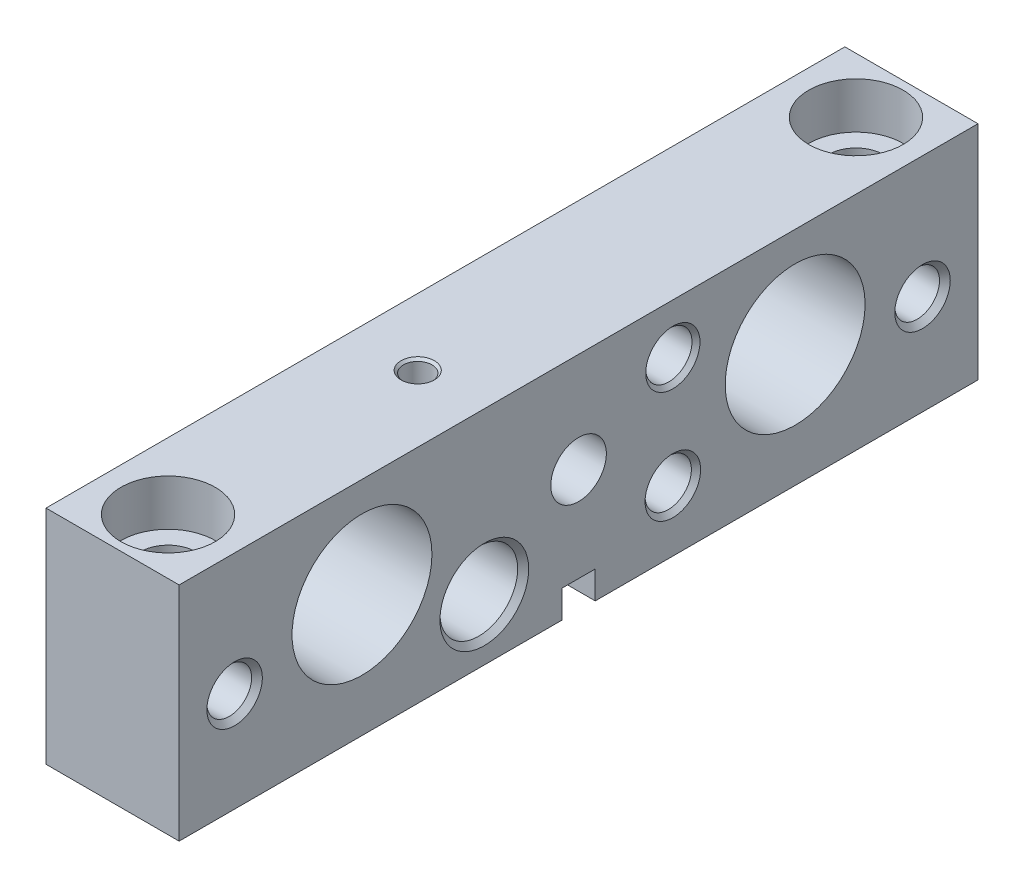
from build123d import *

# Parameters (mm, degrees)
EXTRUDE1_DEPTH     = 19.05
SKETCH2_R          = 2.38379
CUT_EXTRUDE1_DEPTH = 6.35
SKETCH9_W          = 19.05
SKETCH9_H          = 10.0076
SKETCH10_W         = 19.05
SKETCH10_H         = 10.0076


with BuildPart() as part:
    # Sketch1 → Extrude1 (new body)
    with BuildSketch(Plane(origin=(0, 0, 0), x_dir=(0, 0, -1), z_dir=(1, 0, 0))):
        Polygon((-57.15, -17.4498), (-2.38379, -17.4498), (-2.38379, -13.4874), (2.38379, -13.4874), (2.38379, -17.4498), (57.15, -17.4498), (57.15, 14.3002), (-57.15, 14.3002), align=None)
    extrude(amount=EXTRUDE1_DEPTH)

    # Sketch2 → Cut-Extrude1 (cut)
    with BuildSketch(Plane(origin=(0, -13.4874, 0), x_dir=(-1, 0, 0), z_dir=(0, 1, 0))):
        with Locations(Location((-9.525, 0, 0), (0, 0, 90))):
            Circle(SKETCH2_R)
    extrude(amount=CUT_EXTRUDE1_DEPTH, mode=Mode.SUBTRACT)

    # Sketch3 → Cut-Revolve1 (revolve, cut)
    with BuildSketch(Plane(origin=(0, -8.7122, 0), x_dir=(-1, 0, 0), z_dir=(0, 1, 0)), mode=Mode.PRIVATE) as cut_revolve1_sk:
        Polygon((-19.05, -13.4874), (-19.05, -9.5123), (-18.3896, -10.1727), (-0.6604, -10.1727), (0, -9.5123), (0, -13.4874), align=None)
    revolve(cut_revolve1_sk.sketch.rotate(Axis((0, -8.7122, -13.4874), (1, 0, 0)), 180), axis=Axis((0, -8.7122, -13.4874), (1, 0, 0)), mode=Mode.SUBTRACT)

    # Sketch4 → Cut-Revolve2 (revolve, cut)
    with BuildSketch(Plane(origin=(0, -8.7122, 0), x_dir=(-1, 0, 0), z_dir=(0, 1, 0)), mode=Mode.PRIVATE) as cut_revolve2_sk:
        Polygon((-19.05, 13.4874), (-19.05, 19.8374), (-18.2626, 19.05), (-0.7874, 19.05), (0, 19.8374), (0, 13.4874), align=None)
    revolve(cut_revolve2_sk.sketch.rotate(Axis((0, -8.7122, 13.4874), (1, 0, 0)), 180), axis=Axis((0, -8.7122, 13.4874), (1, 0, 0)), mode=Mode.SUBTRACT)

    # Sketch5 → Cut-Revolve3 (revolve, cut)
    with BuildSketch(Plane(origin=(0, 7.1628, 0), x_dir=(-1, 0, 0), z_dir=(0, 1, 0)), mode=Mode.PRIVATE) as cut_revolve3_sk:
        Polygon((-19.05, -13.4874), (-19.05, -9.6074), (-18.4795, -10.1779), (-0.5705, -10.1779), (0, -9.6074), (0, -13.4874), align=None)
    revolve(cut_revolve3_sk.sketch.rotate(Axis((0, 7.1628, -13.4874), (1, 0, 0)), 180), axis=Axis((0, 7.1628, -13.4874), (1, 0, 0)), mode=Mode.SUBTRACT)

    # Sketch6 → Cut-Revolve4 (revolve, cut)
    with BuildSketch(Plane.XY.offset(-49.2125), mode=Mode.PRIVATE) as cut_revolve4_sk:
        Polygon((9.525, 14.3002), (16.27251, 14.3002), (16.27251, 7.6962), (13.49375, 7.6962), (13.49375, -17.4498), (9.525, -17.4498), align=None)
    revolve(cut_revolve4_sk.sketch.rotate(Axis((9.525, -17.4498, -49.2125), (0, 1, 0)), 270), axis=Axis((9.525, -17.4498, -49.2125), (0, 1, 0)), mode=Mode.SUBTRACT)

    # Sketch7 → Cut-Revolve5 (revolve, cut)
    with BuildSketch(Plane.XY.offset(49.2125), mode=Mode.PRIVATE) as cut_revolve5_sk:
        Polygon((9.525, 14.3002), (16.27251, 14.3002), (16.27251, 7.6962), (13.49375, 7.6962), (13.49375, -17.4498), (9.525, -17.4498), align=None)
    revolve(cut_revolve5_sk.sketch.rotate(Axis((9.525, -17.4498, 49.2125), (0, 1, 0)), 270), axis=Axis((9.525, -17.4498, 49.2125), (0, 1, 0)), mode=Mode.SUBTRACT)

    # Sketch8 → Cut-Revolve6 (revolve, cut)
    with BuildSketch(Plane.XY.offset(13.4874), mode=Mode.PRIVATE) as cut_revolve6_sk:
        Polygon((9.525, 14.3002), (11.9126, 14.3002), (11.5697, 13.9573), (11.5697, -3.4798), (9.525, -4.660308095), align=None)
    revolve(cut_revolve6_sk.sketch.rotate(Axis((9.525, -4.660308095, 13.4874), (0, 1, 0)), 270), axis=Axis((9.525, -4.660308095, 13.4874), (0, 1, 0)), mode=Mode.SUBTRACT)

    # Sketch9 → Cut-Revolve7 (revolve, cut)
    with BuildSketch(Plane(origin=(0, 0.0254, 0), x_dir=(-1, 0, 0), z_dir=(0, 1, 0)), mode=Mode.PRIVATE) as cut_revolve7_sk:
        with Locations((-9.525, 35.9918)):
            Rectangle(SKETCH9_W, SKETCH9_H)
    revolve(cut_revolve7_sk.sketch.rotate(Axis((0, 0.0254, 30.988), (1, 0, 0)), 180), axis=Axis((0, 0.0254, 30.988), (1, 0, 0)), mode=Mode.SUBTRACT)

    # Sketch10 → Cut-Revolve8 (revolve, cut)
    with BuildSketch(Plane(origin=(0, 0.0254, 0), x_dir=(-1, 0, 0), z_dir=(0, 1, 0)), mode=Mode.PRIVATE) as cut_revolve8_sk:
        with Locations((-9.525, -25.9842)):
            Rectangle(SKETCH10_W, SKETCH10_H)
    revolve(cut_revolve8_sk.sketch.rotate(Axis((0, 0.0254, -30.988), (1, 0, 0)), 180), axis=Axis((0, 0.0254, -30.988), (1, 0, 0)), mode=Mode.SUBTRACT)

    # Sketch11 → Cut-Revolve9 (revolve, cut)
    with BuildSketch(Plane(origin=(0, 0.0254, 0), x_dir=(-1, 0, 0), z_dir=(0, 1, 0)), mode=Mode.PRIVATE) as cut_revolve9_sk:
        Polygon((0, 0), (0, -2.413), (-0.4318, -1.9812), (-9.0932, -1.9812), (-9.525, -2.413), (-9.525, -3.9751), (-19.05, -3.9751), (-19.05, 0), align=None)
    revolve(cut_revolve9_sk.sketch.rotate(Axis((19.05, 0.0254, 0), (-1, 0, 0)), 180), axis=Axis((19.05, 0.0254, 0), (-1, 0, 0)), mode=Mode.SUBTRACT)

    # Sketch13 → Cut-Revolve10 (revolve, cut)
    with BuildSketch(Plane(origin=(0, -3.1496, 0), x_dir=(-1, 0, 0), z_dir=(0, 1, 0)), mode=Mode.PRIVATE) as cut_revolve10_sk:
        Polygon((-19.05, -49.2125), (-19.05, -45.24375), (-18.28165, -46.0121), (-0.76835, -46.0121), (0, -45.24375), (0, -49.2125), align=None)
    revolve(cut_revolve10_sk.sketch.rotate(Axis((0, -3.1496, -49.2125), (1, 0, 0)), 180), axis=Axis((0, -3.1496, -49.2125), (1, 0, 0)), mode=Mode.SUBTRACT)

    # Sketch12 → Cut-Revolve11 (revolve, cut)
    with BuildSketch(Plane(origin=(0, -3.1496, 0), x_dir=(-1, 0, 0), z_dir=(0, 1, 0)), mode=Mode.PRIVATE) as cut_revolve11_sk:
        Polygon((-19.05, 49.2125), (-19.05, 53.18125), (-18.28165, 52.4129), (-0.76835, 52.4129), (0, 53.18125), (0, 49.2125), align=None)
    revolve(cut_revolve11_sk.sketch.rotate(Axis((0, -3.1496, 49.2125), (1, 0, 0)), 180), axis=Axis((0, -3.1496, 49.2125), (1, 0, 0)), mode=Mode.SUBTRACT)


solid = part.part
